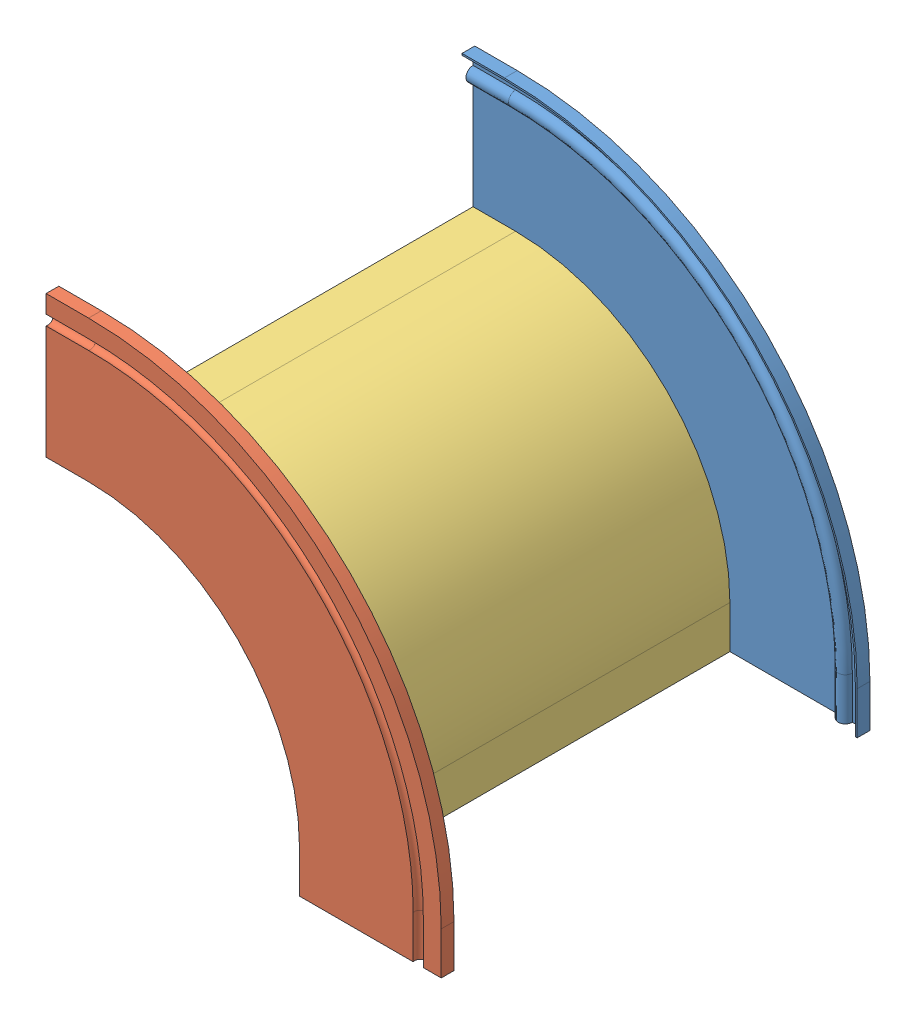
SolidWorks assembly FTVO90.SLDASM, configuration 100 300 (file format 4100). Lengths in mm.
Overall size (278.79 278.79 302.43).
3 component instances, 3 part files, 6 mates.
Components (placement in the parent):
- FTVO inside-1: FTVO inside.SLDPRT [100 100-600] at (8.821 -97.2766 61.4335)
- FTVO outside-1: FTVO outside.SLDPRT [100 100-600] at (8.821 -97.2766 363.8615)
- base of FTVO90-1: base of FTVO90.SLDPRT [100 300] at (-171.179 82.7234 63.8615) size (181.21 181.21 300)
Mates (geometry in assembly coordinates):
- Coincident1: coincident anti-aligned: plane of FTVO inside-1 through (86.393 -67.2766 63.8615) normal (0 0 1); plane of base of FTVO90-1 through (-141.179 -67.2766 63.8615) normal (0 0 -1)
- Coincident2: coincident anti-aligned: plane of FTVO outside-1 through (86.393 -67.2766 363.8615) normal (0 0 -1); plane of base of FTVO90-1 through (-141.179 -67.2766 363.8615) normal (0 0 1)
- Coincident3: coincident anti-aligned: plane of FTVO outside-1 through (-141.179 82.7234 363.8615) normal (0 1 0); plane of base of FTVO90-1 through (-141.179 82.7234 363.8615) normal (0 -1 0)
- Coincident4: coincident anti-aligned: plane of FTVO inside-1 through (-141.179 82.7234 63.8615) normal (0 1 0); plane of base of FTVO90-1 through (-141.179 82.7234 363.8615) normal (0 -1 0)
- Coincident5: coincident aligned: plane of FTVO inside-1 through (-171.179 165.2954 63.8615) normal (-1 0 0); plane of base of FTVO90-1 through (-171.179 82.7234 363.8615) normal (-1 0 0)
- Coincident7: coincident aligned: plane of FTVO outside-1 through (-171.179 165.2954 363.8615) normal (-1 0 0); plane of base of FTVO90-1 through (-171.179 82.7234 363.8615) normal (-1 0 0)
